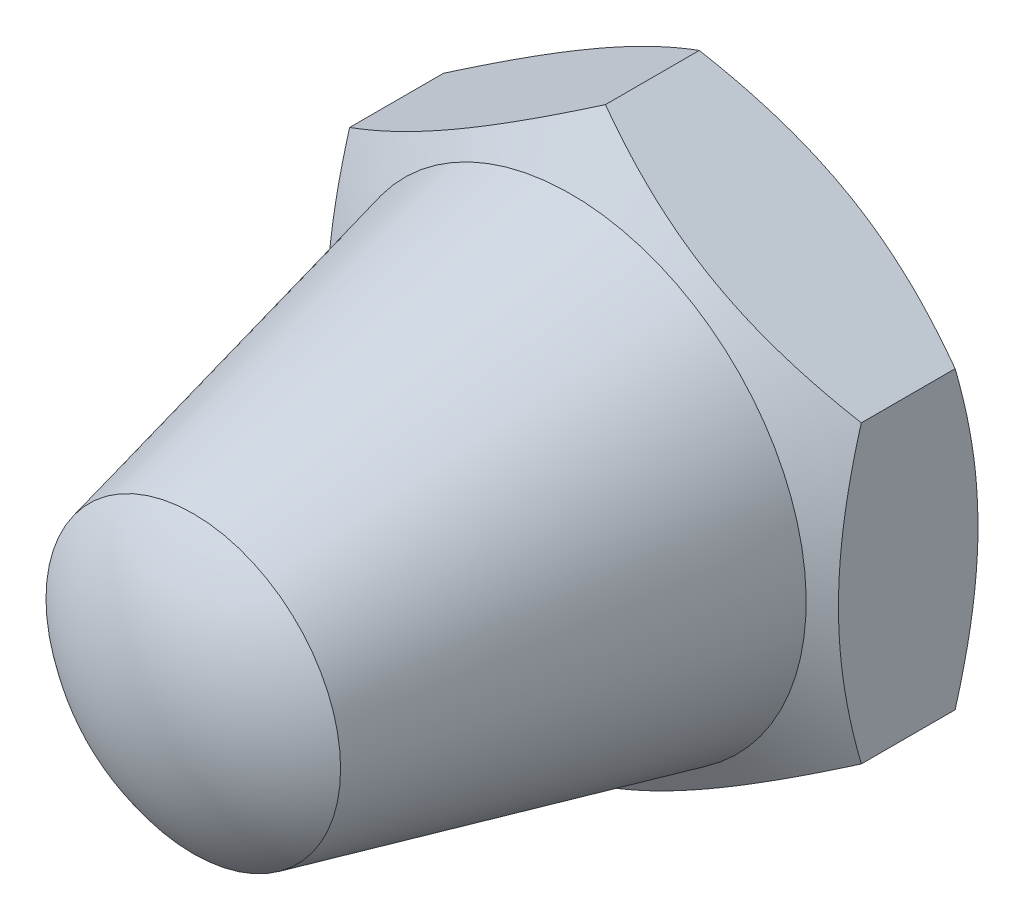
ISO-10303-21;
HEADER;
FILE_DESCRIPTION(('STEP AP214'),'2;1');
FILE_NAME('part.step','',(''),(''),'','','');
FILE_SCHEMA(('AUTOMOTIVE_DESIGN { 1 0 10303 214 1 1 1 1 }'));
ENDSEC;
DATA;
#1=APPLICATION_CONTEXT('core data for automotive mechanical design processes');
#2=APPLICATION_PROTOCOL_DEFINITION('international standard','automotive_design',2000,#1);
#3=PRODUCT_CONTEXT('',#1,'mechanical');
#4=PRODUCT('Part','Part','',(#3));
#5=PRODUCT_RELATED_PRODUCT_CATEGORY('part','',(#4));
#6=PRODUCT_DEFINITION_FORMATION('','',#4);
#7=PRODUCT_DEFINITION_CONTEXT('part definition',#1,'design');
#8=PRODUCT_DEFINITION('design','',#6,#7);
#9=PRODUCT_DEFINITION_SHAPE('','',#8);
#10=(LENGTH_UNIT() NAMED_UNIT(*) SI_UNIT(.MILLI.,.METRE.));
#11=(NAMED_UNIT(*) PLANE_ANGLE_UNIT() SI_UNIT($,.RADIAN.));
#12=(NAMED_UNIT(*) SI_UNIT($,.STERADIAN.) SOLID_ANGLE_UNIT());
#13=UNCERTAINTY_MEASURE_WITH_UNIT(LENGTH_MEASURE(1.E-05),#10,'distance_accuracy_value','');
#14=(GEOMETRIC_REPRESENTATION_CONTEXT(3) GLOBAL_UNCERTAINTY_ASSIGNED_CONTEXT((#13)) GLOBAL_UNIT_ASSIGNED_CONTEXT((#10,
#11,#12)) REPRESENTATION_CONTEXT('',''));
#15=CARTESIAN_POINT('',(0.,0.,0.));
#16=DIRECTION('',(0.,0.,1.));
#17=DIRECTION('',(1.,0.,0.));
#18=AXIS2_PLACEMENT_3D('',#15,#16,#17);
#19=CARTESIAN_POINT('',(0.,0.,0.));
#20=DIRECTION('',(0.,0.,1.));
#21=DIRECTION('',(0.500000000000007,-0.866025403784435,0.));
#22=AXIS2_PLACEMENT_3D('',#19,#20,#21);
#23=CONICAL_SURFACE('',#22,5.5,1.0471975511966);
#24=CARTESIAN_POINT('',(0.000200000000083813,-6.3509684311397,0.491306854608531));
#25=CARTESIAN_POINT('',(-0.120696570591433,-6.28116876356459,0.451013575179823));
#26=CARTESIAN_POINT('',(-0.242043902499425,-6.21110884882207,0.41254891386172));
#27=CARTESIAN_POINT('',(-0.485724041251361,-6.07042005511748,0.33978047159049));
#28=CARTESIAN_POINT('',(-0.608057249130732,-5.9997909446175,0.305478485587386));
#29=CARTESIAN_POINT('',(-0.977015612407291,-5.78677273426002,0.209489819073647));
#30=CARTESIAN_POINT('',(-1.22509718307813,-5.64354277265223,0.154892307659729));
#31=CARTESIAN_POINT('',(-1.59634674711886,-5.4292017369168,0.0908698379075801));
#32=CARTESIAN_POINT('',(-1.71840546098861,-5.35873110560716,0.0726315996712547));
#33=CARTESIAN_POINT('',(-1.96307442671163,-5.21747141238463,0.04204851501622));
#34=CARTESIAN_POINT('',(-2.08568462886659,-5.14668237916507,0.0297031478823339));
#35=CARTESIAN_POINT('',(-2.33111799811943,-5.00498135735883,0.0112204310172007));
#36=CARTESIAN_POINT('',(-2.45394076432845,-4.93406960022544,0.00507603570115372));
#37=CARTESIAN_POINT('',(-2.69969299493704,-4.79218448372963,-0.000879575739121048));
#38=CARTESIAN_POINT('',(-2.82262245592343,-4.7212111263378,-0.000690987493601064));
#39=CARTESIAN_POINT('',(-3.15941408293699,-4.52676438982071,0.008530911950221));
#40=CARTESIAN_POINT('',(-3.37316601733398,-4.40335465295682,0.0240139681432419));
#41=CARTESIAN_POINT('',(-3.79925015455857,-4.15735486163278,0.0731121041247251));
#42=CARTESIAN_POINT('',(-4.01158085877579,-4.03476567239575,0.106743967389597));
#43=CARTESIAN_POINT('',(-4.43852257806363,-3.78827075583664,0.190814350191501));
#44=CARTESIAN_POINT('',(-4.6530797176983,-3.66439613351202,0.241609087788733));
#45=CARTESIAN_POINT('',(-5.0789942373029,-3.41849427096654,0.356892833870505));
#46=CARTESIAN_POINT('',(-5.29035707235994,-3.29646388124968,0.421354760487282));
#47=CARTESIAN_POINT('',(-5.5002,-3.17531101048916,0.491306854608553));
#48=B_SPLINE_CURVE_WITH_KNOTS('',3,(#24,#25,#26,#27,#28,#29,#30,#31,#32,#33,#34,#35,#36,#37,#38,
#39,#40,#41,#42,#43,#44,#45,#46,#47),.UNSPECIFIED.,.F.,.F.,(4,2,2,2,2,2,2,2,2,2,2,4),(0.,
0.435859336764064,0.871905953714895,1.74581116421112,2.17206086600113,2.59827289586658,
3.02400011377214,3.44971418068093,4.19085033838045,4.93267305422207,5.6909489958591,
6.44773620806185),.UNSPECIFIED.);
#49=CARTESIAN_POINT('',(-2.74999999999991,-4.76313972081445,0.));
#50=VERTEX_POINT('',#49);
#51=CARTESIAN_POINT('',(-5.5,-3.175426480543,0.491240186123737));
#52=VERTEX_POINT('',#51);
#53=EDGE_CURVE('E144',#50,#52,#48,.T.);
#54=ORIENTED_EDGE('',*,*,#53,.T.);
#55=CARTESIAN_POINT('',(-5.5,-3.17565742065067,0.491306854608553));
#56=CARTESIAN_POINT('',(-5.5,-3.03605808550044,0.451013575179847));
#57=CARTESIAN_POINT('',(-5.5,-2.8959382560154,0.412548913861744));
#58=CARTESIAN_POINT('',(-5.5,-2.61456066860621,0.339780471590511));
#59=CARTESIAN_POINT('',(-5.5,-2.47330244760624,0.305478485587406));
#60=CARTESIAN_POINT('',(-5.5,-2.04726602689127,0.209489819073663));
#61=CARTESIAN_POINT('',(-5.5,-1.76080610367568,0.154892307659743));
#62=CARTESIAN_POINT('',(-5.5,-1.33212403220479,0.0908698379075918));
#63=CARTESIAN_POINT('',(-5.5,-1.19118276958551,0.0726315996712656));
#64=CARTESIAN_POINT('',(-5.5,-0.908663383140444,0.0420485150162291));
#65=CARTESIAN_POINT('',(-5.5,-0.767085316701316,0.029703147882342));
#66=CARTESIAN_POINT('',(-5.5,-0.483683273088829,0.0112204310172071));
#67=CARTESIAN_POINT('',(-5.5,-0.341859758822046,0.00507603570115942));
#68=CARTESIAN_POINT('',(-5.5,-0.058089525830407,-0.000879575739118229));
#69=CARTESIAN_POINT('',(-5.5,0.0838571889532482,-0.000690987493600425));
#70=CARTESIAN_POINT('',(-5.5,0.472750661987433,0.00853091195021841));
#71=CARTESIAN_POINT('',(-5.5,0.719570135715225,0.0240139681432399));
#72=CARTESIAN_POINT('',(-5.5,1.21156971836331,0.0731121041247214));
#73=CARTESIAN_POINT('',(-5.5,1.45674809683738,0.106743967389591));
#74=CARTESIAN_POINT('',(-5.5,1.9497379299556,0.19081435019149));
#75=CARTESIAN_POINT('',(-5.5,2.19748717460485,0.24160908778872));
#76=CARTESIAN_POINT('',(-5.5,2.68929089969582,0.356892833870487));
#77=CARTESIAN_POINT('',(-5.5,2.93335167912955,0.421354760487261));
#78=CARTESIAN_POINT('',(-5.5,3.1756574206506,0.49130685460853));
#79=B_SPLINE_CURVE_WITH_KNOTS('',3,(#55,#56,#57,#58,#59,#60,#61,#62,#63,#64,#65,#66,#67,#68,#69,
#70,#71,#72,#73,#74,#75,#76,#77,#78),.UNSPECIFIED.,.F.,.F.,(4,2,2,2,2,2,2,2,2,2,2,4),(0.,
0.435859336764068,0.871905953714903,1.74581116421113,2.17206086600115,2.5982728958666,
3.02400011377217,3.44971418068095,4.19085033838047,4.93267305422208,5.6909489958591,
6.44773620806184),.UNSPECIFIED.);
#80=CARTESIAN_POINT('',(-5.5,0.,0.));
#81=VERTEX_POINT('',#80);
#82=EDGE_CURVE('E96',#52,#81,#79,.T.);
#83=ORIENTED_EDGE('',*,*,#82,.T.);
#84=CARTESIAN_POINT('',(0.,0.,0.));
#85=DIRECTION('',(0.,0.,-1.));
#86=DIRECTION('',(-0.500000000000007,0.866025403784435,0.));
#87=AXIS2_PLACEMENT_3D('',#84,#85,#86);
#88=CIRCLE('',#87,5.5);
#89=EDGE_CURVE('E107',#50,#81,#88,.T.);
#90=ORIENTED_EDGE('',*,*,#89,.F.);
#91=EDGE_LOOP('',(#54,#83,#90));
#92=FACE_BOUND('',#91,.T.);
#93=ADVANCED_FACE('F14',(#92),#23,.T.);
#94=CARTESIAN_POINT('',(-2.75000000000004,4.76313972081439,0.));
#95=VERTEX_POINT('',#94);
#96=EDGE_CURVE('E104',#81,#95,#88,.T.);
#97=ORIENTED_EDGE('',*,*,#96,.F.);
#98=CARTESIAN_POINT('',(-5.5,3.17542648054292,0.491240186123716));
#99=VERTEX_POINT('',#98);
#100=EDGE_CURVE('E110',#81,#99,#79,.T.);
#101=ORIENTED_EDGE('',*,*,#100,.T.);
#102=CARTESIAN_POINT('',(-10.1652754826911,0.481928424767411,2.70008996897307));
#103=CARTESIAN_POINT('',(-9.95700252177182,0.602174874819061,2.58329769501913));
#104=CARTESIAN_POINT('',(-9.74825451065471,0.722695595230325,2.46761578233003));
#105=CARTESIAN_POINT('',(-9.32955588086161,0.964431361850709,2.23909648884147));
#106=CARTESIAN_POINT('',(-9.11960508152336,1.08564651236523,2.12625954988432));
#107=CARTESIAN_POINT('',(-8.69718017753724,1.32953364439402,1.90349331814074));
#108=CARTESIAN_POINT('',(-8.48469857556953,1.45220995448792,1.79358291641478));
#109=CARTESIAN_POINT('',(-8.05805535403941,1.69853253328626,1.57821612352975));
#110=CARTESIAN_POINT('',(-7.84389381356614,1.82217875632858,1.4727595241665));
#111=CARTESIAN_POINT('',(-7.40651825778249,2.07469765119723,1.26412065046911));
#112=CARTESIAN_POINT('',(-7.18323704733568,2.20360911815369,1.16112517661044));
#113=CARTESIAN_POINT('',(-6.73407282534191,2.46293420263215,0.962850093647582));
#114=CARTESIAN_POINT('',(-6.5081895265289,2.59334798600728,0.867571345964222));
#115=CARTESIAN_POINT('',(-6.05387554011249,2.85564628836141,0.687206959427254));
#116=CARTESIAN_POINT('',(-5.82545097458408,2.98752727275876,0.602100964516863));
#117=CARTESIAN_POINT('',(-5.36532503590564,3.25318110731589,0.444791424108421));
#118=CARTESIAN_POINT('',(-5.13362471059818,3.38695335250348,0.372583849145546));
#119=CARTESIAN_POINT('',(-4.66811361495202,3.65571630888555,0.24490271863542));
#120=CARTESIAN_POINT('',(-4.43432219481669,3.79069584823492,0.189336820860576));
#121=CARTESIAN_POINT('',(-3.96380196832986,4.06235082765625,0.0980537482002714));
#122=CARTESIAN_POINT('',(-3.72707344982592,4.19902610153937,0.0623346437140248));
#123=CARTESIAN_POINT('',(-3.25496508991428,4.47159799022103,0.0140608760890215));
#124=CARTESIAN_POINT('',(-3.01960886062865,4.60748097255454,0.00120590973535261));
#125=CARTESIAN_POINT('',(-2.54879233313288,4.87930702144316,-0.00104219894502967));
#126=CARTESIAN_POINT('',(-2.31333203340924,5.01525008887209,0.00956501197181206));
#127=CARTESIAN_POINT('',(-1.91442654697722,5.24555827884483,0.0466564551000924));
#128=CARTESIAN_POINT('',(-1.75055801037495,5.34016782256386,0.0674262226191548));
#129=CARTESIAN_POINT('',(-1.42400911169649,5.52870091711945,0.119054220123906));
#130=CARTESIAN_POINT('',(-1.26132891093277,5.6226243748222,0.149913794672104));
#131=CARTESIAN_POINT('',(-0.775293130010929,5.90323726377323,0.256006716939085));
#132=CARTESIAN_POINT('',(-0.454121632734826,6.08866571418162,0.344735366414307));
#133=CARTESIAN_POINT('',(0.0261416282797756,6.36594583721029,0.498757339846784));
#134=CARTESIAN_POINT('',(0.187719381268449,6.45923279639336,0.554305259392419));
#135=CARTESIAN_POINT('',(0.509305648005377,6.64490071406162,0.671212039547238));
#136=CARTESIAN_POINT('',(0.669314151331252,6.73728166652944,0.732570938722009));
#137=CARTESIAN_POINT('',(0.987811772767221,6.92116635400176,0.860111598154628));
#138=CARTESIAN_POINT('',(1.14630136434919,7.01267036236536,0.926291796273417));
#139=CARTESIAN_POINT('',(1.46196516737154,7.19491894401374,1.06269233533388));
#140=CARTESIAN_POINT('',(1.61913939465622,7.28566352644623,1.13291262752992));
#141=CARTESIAN_POINT('',(1.99164400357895,7.50072916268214,1.30396587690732));
#142=CARTESIAN_POINT('',(2.20645001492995,7.62474747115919,1.40631864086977));
#143=CARTESIAN_POINT('',(2.63421533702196,7.871717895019,1.61606120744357));
#144=CARTESIAN_POINT('',(2.8471745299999,7.99466994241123,1.72345132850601));
#145=CARTESIAN_POINT('',(3.27158775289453,8.23970503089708,1.94225171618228));
#146=CARTESIAN_POINT('',(3.48304145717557,8.36178788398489,2.05366282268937));
#147=CARTESIAN_POINT('',(3.90466020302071,8.60520958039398,2.27969591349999));
#148=CARTESIAN_POINT('',(4.11482521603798,8.72654840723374,2.39431796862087));
#149=CARTESIAN_POINT('',(4.53430461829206,8.96873495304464,2.62629189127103));
#150=CARTESIAN_POINT('',(4.74361781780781,9.08958198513,2.74364662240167));
#151=CARTESIAN_POINT('',(5.16133406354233,9.33075057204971,2.98049832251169));
#152=CARTESIAN_POINT('',(5.36973710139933,9.45107212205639,3.09999531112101));
#153=CARTESIAN_POINT('',(5.99374202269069,9.81134153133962,3.46109375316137));
#154=CARTESIAN_POINT('',(6.40819798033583,10.0506277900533,3.70533517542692));
#155=CARTESIAN_POINT('',(7.19985126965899,10.5076890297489,4.17784413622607));
#156=CARTESIAN_POINT('',(7.57722888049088,10.7255680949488,4.4057107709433));
#157=CARTESIAN_POINT('',(8.33057592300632,11.1605132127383,4.86456308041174));
#158=CARTESIAN_POINT('',(8.70654530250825,11.3775792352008,5.09554886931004));
#159=CARTESIAN_POINT('',(9.45642510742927,11.8105225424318,5.55929876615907));
#160=CARTESIAN_POINT('',(9.83033833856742,12.026401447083,5.79205683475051));
#161=CARTESIAN_POINT('',(10.5772652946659,12.4576399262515,6.25943215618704));
#162=CARTESIAN_POINT('',(10.9502790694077,12.6729995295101,6.49404930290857));
#163=CARTESIAN_POINT('',(11.3229623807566,12.8881683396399,6.72935957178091));
#164=B_SPLINE_CURVE_WITH_KNOTS('',3,(#102,#103,#104,#105,#106,#107,#108,#109,#110,#111,#112,
#113,#114,#115,#116,#117,#118,#119,#120,#121,#122,#123,#124,#125,#126,#127,#128,#129,#130,#131,
#132,#133,#134,#135,#136,#137,#138,#139,#140,#141,#142,#143,#144,#145,#146,#147,#148,#149,#150,
#151,#152,#153,#154,#155,#156,#157,#158,#159,#160,#161,#162,#163),.UNSPECIFIED.,.F.,.F.,(4,2,2,
2,2,2,2,2,2,2,2,2,2,2,2,2,2,2,2,2,2,2,2,2,2,2,2,2,2,2,4),(0.,0.8020666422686,1.60425709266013,
2.41075980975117,3.21722478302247,4.05003181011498,4.88293167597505,5.71413594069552,
6.54508008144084,7.37132416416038,8.19748790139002,9.01271815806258,9.82796068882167,
10.3987510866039,10.9696175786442,12.1119712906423,12.6959233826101,13.2798793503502,
13.863646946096,14.4474074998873,15.2523068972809,16.0572572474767,16.8623767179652,
17.667513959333,18.4735366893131,19.2795668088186,20.8914029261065,22.3666098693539,
23.84187094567,25.3133687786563,26.7847832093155),.UNSPECIFIED.);
#165=EDGE_CURVE('E182',#99,#95,#164,.T.);
#166=ORIENTED_EDGE('',*,*,#165,.T.);
#167=EDGE_LOOP('',(#97,#101,#166));
#168=FACE_BOUND('',#167,.T.);
#169=ADVANCED_FACE('F139',(#168),#23,.T.);
#170=CARTESIAN_POINT('',(2.74999999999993,4.76313972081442,0.));
#171=VERTEX_POINT('',#170);
#172=EDGE_CURVE('E109',#95,#171,#88,.T.);
#173=ORIENTED_EDGE('',*,*,#172,.F.);
#174=CARTESIAN_POINT('',(0.,6.35085296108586,0.491240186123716));
#175=VERTEX_POINT('',#174);
#176=EDGE_CURVE('E175',#95,#175,#164,.T.);
#177=ORIENTED_EDGE('',*,*,#176,.T.);
#178=CARTESIAN_POINT('',(-0.000200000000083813,6.3509684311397,0.491306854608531));
#179=CARTESIAN_POINT('',(0.120696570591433,6.28116876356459,0.451013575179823));
#180=CARTESIAN_POINT('',(0.242043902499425,6.21110884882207,0.41254891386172));
#181=CARTESIAN_POINT('',(0.485724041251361,6.07042005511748,0.33978047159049));
#182=CARTESIAN_POINT('',(0.608057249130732,5.9997909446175,0.305478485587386));
#183=CARTESIAN_POINT('',(0.977015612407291,5.78677273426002,0.209489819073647));
#184=CARTESIAN_POINT('',(1.22509718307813,5.64354277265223,0.154892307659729));
#185=CARTESIAN_POINT('',(1.59634674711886,5.4292017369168,0.0908698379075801));
#186=CARTESIAN_POINT('',(1.71840546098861,5.35873110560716,0.0726315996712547));
#187=CARTESIAN_POINT('',(1.96307442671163,5.21747141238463,0.04204851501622));
#188=CARTESIAN_POINT('',(2.08568462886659,5.14668237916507,0.0297031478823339));
#189=CARTESIAN_POINT('',(2.33111799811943,5.00498135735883,0.0112204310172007));
#190=CARTESIAN_POINT('',(2.45394076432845,4.93406960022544,0.00507603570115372));
#191=CARTESIAN_POINT('',(2.69969299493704,4.79218448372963,-0.000879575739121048));
#192=CARTESIAN_POINT('',(2.82262245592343,4.7212111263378,-0.000690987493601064));
#193=CARTESIAN_POINT('',(3.15941408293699,4.52676438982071,0.008530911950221));
#194=CARTESIAN_POINT('',(3.37316601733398,4.40335465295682,0.0240139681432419));
#195=CARTESIAN_POINT('',(3.79925015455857,4.15735486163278,0.0731121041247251));
#196=CARTESIAN_POINT('',(4.01158085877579,4.03476567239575,0.106743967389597));
#197=CARTESIAN_POINT('',(4.43852257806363,3.78827075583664,0.190814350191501));
#198=CARTESIAN_POINT('',(4.6530797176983,3.66439613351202,0.241609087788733));
#199=CARTESIAN_POINT('',(5.0789942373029,3.41849427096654,0.356892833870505));
#200=CARTESIAN_POINT('',(5.29035707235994,3.29646388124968,0.421354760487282));
#201=CARTESIAN_POINT('',(5.5002,3.17531101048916,0.491306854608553));
#202=B_SPLINE_CURVE_WITH_KNOTS('',3,(#178,#179,#180,#181,#182,#183,#184,#185,#186,#187,#188,
#189,#190,#191,#192,#193,#194,#195,#196,#197,#198,#199,#200,#201),.UNSPECIFIED.,.F.,.F.,(4,2,2,
2,2,2,2,2,2,2,2,4),(0.,0.435859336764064,0.871905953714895,1.74581116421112,2.17206086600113,
2.59827289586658,3.02400011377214,3.44971418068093,4.19085033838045,4.93267305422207,
5.6909489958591,6.44773620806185),.UNSPECIFIED.);
#203=EDGE_CURVE('E219',#175,#171,#202,.T.);
#204=ORIENTED_EDGE('',*,*,#203,.T.);
#205=EDGE_LOOP('',(#173,#177,#204));
#206=FACE_BOUND('',#205,.T.);
#207=ADVANCED_FACE('F282',(#206),#23,.T.);
#208=CARTESIAN_POINT('',(5.5,0.,0.));
#209=VERTEX_POINT('',#208);
#210=EDGE_CURVE('E271',#171,#209,#88,.T.);
#211=ORIENTED_EDGE('',*,*,#210,.F.);
#212=CARTESIAN_POINT('',(5.5,3.175426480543,0.491240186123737));
#213=VERTEX_POINT('',#212);
#214=EDGE_CURVE('E167',#171,#213,#202,.T.);
#215=ORIENTED_EDGE('',*,*,#214,.T.);
#216=CARTESIAN_POINT('',(5.5,3.17565742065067,0.491306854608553));
#217=CARTESIAN_POINT('',(5.5,3.03605808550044,0.451013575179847));
#218=CARTESIAN_POINT('',(5.5,2.8959382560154,0.412548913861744));
#219=CARTESIAN_POINT('',(5.5,2.61456066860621,0.339780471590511));
#220=CARTESIAN_POINT('',(5.5,2.47330244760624,0.305478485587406));
#221=CARTESIAN_POINT('',(5.5,2.04726602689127,0.209489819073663));
#222=CARTESIAN_POINT('',(5.5,1.76080610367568,0.154892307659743));
#223=CARTESIAN_POINT('',(5.5,1.33212403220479,0.0908698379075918));
#224=CARTESIAN_POINT('',(5.5,1.19118276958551,0.0726315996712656));
#225=CARTESIAN_POINT('',(5.5,0.908663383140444,0.0420485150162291));
#226=CARTESIAN_POINT('',(5.5,0.767085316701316,0.029703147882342));
#227=CARTESIAN_POINT('',(5.5,0.483683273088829,0.0112204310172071));
#228=CARTESIAN_POINT('',(5.5,0.341859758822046,0.00507603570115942));
#229=CARTESIAN_POINT('',(5.5,0.058089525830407,-0.000879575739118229));
#230=CARTESIAN_POINT('',(5.5,-0.0838571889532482,-0.000690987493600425));
#231=CARTESIAN_POINT('',(5.5,-0.472750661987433,0.00853091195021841));
#232=CARTESIAN_POINT('',(5.5,-0.719570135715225,0.0240139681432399));
#233=CARTESIAN_POINT('',(5.5,-1.21156971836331,0.0731121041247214));
#234=CARTESIAN_POINT('',(5.5,-1.45674809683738,0.106743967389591));
#235=CARTESIAN_POINT('',(5.5,-1.9497379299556,0.19081435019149));
#236=CARTESIAN_POINT('',(5.5,-2.19748717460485,0.24160908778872));
#237=CARTESIAN_POINT('',(5.5,-2.68929089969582,0.356892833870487));
#238=CARTESIAN_POINT('',(5.5,-2.93335167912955,0.421354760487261));
#239=CARTESIAN_POINT('',(5.5,-3.1756574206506,0.49130685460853));
#240=B_SPLINE_CURVE_WITH_KNOTS('',3,(#216,#217,#218,#219,#220,#221,#222,#223,#224,#225,#226,
#227,#228,#229,#230,#231,#232,#233,#234,#235,#236,#237,#238,#239),.UNSPECIFIED.,.F.,.F.,(4,2,2,
2,2,2,2,2,2,2,2,4),(0.,0.435859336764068,0.871905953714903,1.74581116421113,2.17206086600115,
2.5982728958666,3.02400011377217,3.44971418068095,4.19085033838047,4.93267305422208,
5.6909489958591,6.44773620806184),.UNSPECIFIED.);
#241=EDGE_CURVE('E217',#213,#209,#240,.T.);
#242=ORIENTED_EDGE('',*,*,#241,.T.);
#243=EDGE_LOOP('',(#211,#215,#242));
#244=FACE_BOUND('',#243,.T.);
#245=ADVANCED_FACE('F283',(#244),#23,.T.);
#246=CARTESIAN_POINT('',(2.75000000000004,-4.76313972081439,0.));
#247=VERTEX_POINT('',#246);
#248=EDGE_CURVE('E277',#209,#247,#88,.T.);
#249=ORIENTED_EDGE('',*,*,#248,.F.);
#250=CARTESIAN_POINT('',(5.5,-3.17542648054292,0.491240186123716));
#251=VERTEX_POINT('',#250);
#252=EDGE_CURVE('E159',#209,#251,#240,.T.);
#253=ORIENTED_EDGE('',*,*,#252,.T.);
#254=CARTESIAN_POINT('',(-4.665275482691,-9.04435101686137,2.70008996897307));
#255=CARTESIAN_POINT('',(-4.45700252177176,-8.92410456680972,2.58329769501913));
#256=CARTESIAN_POINT('',(-4.24825451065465,-8.80358384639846,2.46761578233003));
#257=CARTESIAN_POINT('',(-3.82955588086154,-8.56184807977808,2.23909648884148));
#258=CARTESIAN_POINT('',(-3.61960508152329,-8.44063292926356,2.12625954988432));
#259=CARTESIAN_POINT('',(-3.19718017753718,-8.19674579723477,1.90349331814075));
#260=CARTESIAN_POINT('',(-2.98469857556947,-8.07406948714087,1.79358291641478));
#261=CARTESIAN_POINT('',(-2.55805535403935,-7.82774690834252,1.57821612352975));
#262=CARTESIAN_POINT('',(-2.34389381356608,-7.70410068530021,1.47275952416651));
#263=CARTESIAN_POINT('',(-1.90651825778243,-7.45158179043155,1.26412065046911));
#264=CARTESIAN_POINT('',(-1.68323704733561,-7.32267032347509,1.16112517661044));
#265=CARTESIAN_POINT('',(-1.23407282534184,-7.06334523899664,0.962850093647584));
#266=CARTESIAN_POINT('',(-1.00818952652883,-6.9329314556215,0.867571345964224));
#267=CARTESIAN_POINT('',(-0.553875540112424,-6.67063315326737,0.687206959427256));
#268=CARTESIAN_POINT('',(-0.325450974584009,-6.53875216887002,0.602100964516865));
#269=CARTESIAN_POINT('',(0.13467496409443,-6.27309833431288,0.444791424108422));
#270=CARTESIAN_POINT('',(0.36637528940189,-6.1393260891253,0.372583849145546));
#271=CARTESIAN_POINT('',(0.831886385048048,-5.87056313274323,0.24490271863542));
#272=CARTESIAN_POINT('',(1.06567780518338,-5.73558359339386,0.189336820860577));
#273=CARTESIAN_POINT('',(1.53619803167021,-5.46392861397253,0.0980537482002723));
#274=CARTESIAN_POINT('',(1.77292655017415,-5.32725334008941,0.0623346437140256));
#275=CARTESIAN_POINT('',(2.24503491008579,-5.05468145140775,0.0140608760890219));
#276=CARTESIAN_POINT('',(2.48039113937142,-4.91879846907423,0.00120590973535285));
#277=CARTESIAN_POINT('',(2.95120766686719,-4.64697242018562,-0.00104219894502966));
#278=CARTESIAN_POINT('',(3.18666796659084,-4.5110293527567,0.00956501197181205));
#279=CARTESIAN_POINT('',(3.58557345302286,-4.28072116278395,0.0466564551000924));
#280=CARTESIAN_POINT('',(3.74944198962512,-4.18611161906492,0.0674262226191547));
#281=CARTESIAN_POINT('',(4.07599088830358,-3.99757852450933,0.119054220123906));
#282=CARTESIAN_POINT('',(4.2386710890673,-3.90365506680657,0.149913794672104));
#283=CARTESIAN_POINT('',(4.72470686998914,-3.62304217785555,0.256006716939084));
#284=CARTESIAN_POINT('',(5.04587836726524,-3.43761372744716,0.344735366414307));
#285=CARTESIAN_POINT('',(5.52614162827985,-3.16033360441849,0.498757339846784));
#286=CARTESIAN_POINT('',(5.68771938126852,-3.06704664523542,0.554305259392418));
#287=CARTESIAN_POINT('',(6.00930564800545,-2.88137872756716,0.671212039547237));
#288=CARTESIAN_POINT('',(6.16931415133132,-2.78899777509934,0.732570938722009));
#289=CARTESIAN_POINT('',(6.48781177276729,-2.60511308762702,0.860111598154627));
#290=CARTESIAN_POINT('',(6.64630136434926,-2.51360907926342,0.926291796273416));
#291=CARTESIAN_POINT('',(6.96196516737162,-2.33136049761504,1.06269233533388));
#292=CARTESIAN_POINT('',(7.11913939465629,-2.24061591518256,1.13291262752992));
#293=CARTESIAN_POINT('',(7.49164400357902,-2.02555027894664,1.30396587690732));
#294=CARTESIAN_POINT('',(7.70645001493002,-1.90153197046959,1.40631864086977));
#295=CARTESIAN_POINT('',(8.13421533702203,-1.65456154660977,1.61606120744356));
#296=CARTESIAN_POINT('',(8.34717452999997,-1.53160949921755,1.72345132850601));
#297=CARTESIAN_POINT('',(8.7715877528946,-1.2865744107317,1.94225171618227));
#298=CARTESIAN_POINT('',(8.98304145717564,-1.16449155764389,2.05366282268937));
#299=CARTESIAN_POINT('',(9.40466020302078,-0.921069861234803,2.27969591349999));
#300=CARTESIAN_POINT('',(9.61482521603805,-0.799731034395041,2.39431796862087));
#301=CARTESIAN_POINT('',(10.0343046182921,-0.557544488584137,2.62629189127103));
#302=CARTESIAN_POINT('',(10.2436178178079,-0.436697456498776,2.74364662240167));
#303=CARTESIAN_POINT('',(10.6613340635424,-0.195528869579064,2.98049832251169));
#304=CARTESIAN_POINT('',(10.8697371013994,-0.0752073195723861,3.09999531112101));
#305=CARTESIAN_POINT('',(11.4937420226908,0.285062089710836,3.46109375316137));
#306=CARTESIAN_POINT('',(11.9081979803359,0.524348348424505,3.70533517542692));
#307=CARTESIAN_POINT('',(12.6998512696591,0.981409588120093,4.17784413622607));
#308=CARTESIAN_POINT('',(13.077228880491,1.19928865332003,4.4057107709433));
#309=CARTESIAN_POINT('',(13.8305759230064,1.63423377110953,4.86456308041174));
#310=CARTESIAN_POINT('',(14.2065453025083,1.85129979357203,5.09554886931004));
#311=CARTESIAN_POINT('',(14.9564251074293,2.28424310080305,5.55929876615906));
#312=CARTESIAN_POINT('',(15.3303383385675,2.50012200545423,5.79205683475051));
#313=CARTESIAN_POINT('',(16.077265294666,2.93136048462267,6.25943215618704));
#314=CARTESIAN_POINT('',(16.4502790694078,3.1467200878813,6.49404930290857));
#315=CARTESIAN_POINT('',(16.8229623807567,3.36188889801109,6.72935957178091));
#316=B_SPLINE_CURVE_WITH_KNOTS('',3,(#254,#255,#256,#257,#258,#259,#260,#261,#262,#263,#264,
#265,#266,#267,#268,#269,#270,#271,#272,#273,#274,#275,#276,#277,#278,#279,#280,#281,#282,#283,
#284,#285,#286,#287,#288,#289,#290,#291,#292,#293,#294,#295,#296,#297,#298,#299,#300,#301,#302,
#303,#304,#305,#306,#307,#308,#309,#310,#311,#312,#313,#314,#315),.UNSPECIFIED.,.F.,.F.,(4,2,2,
2,2,2,2,2,2,2,2,2,2,2,2,2,2,2,2,2,2,2,2,2,2,2,2,2,2,2,4),(0.,0.802066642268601,1.60425709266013,
2.41075980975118,3.21722478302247,4.05003181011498,4.88293167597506,5.71413594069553,
6.54508008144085,7.37132416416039,8.19748790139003,9.01271815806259,9.82796068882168,
10.3987510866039,10.9696175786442,12.1119712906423,12.6959233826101,13.2798793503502,
13.863646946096,14.4474074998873,15.2523068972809,16.0572572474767,16.8623767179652,
17.667513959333,18.4735366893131,19.2795668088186,20.8914029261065,22.3666098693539,
23.84187094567,25.3133687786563,26.7847832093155),.UNSPECIFIED.);
#317=EDGE_CURVE('E228',#251,#247,#316,.F.);
#318=ORIENTED_EDGE('',*,*,#317,.T.);
#319=EDGE_LOOP('',(#249,#253,#318));
#320=FACE_BOUND('',#319,.T.);
#321=ADVANCED_FACE('F286',(#320),#23,.T.);
#322=EDGE_CURVE('E239',#247,#50,#88,.T.);
#323=ORIENTED_EDGE('',*,*,#322,.F.);
#324=CARTESIAN_POINT('',(0.,-6.35085296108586,0.491240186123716));
#325=VERTEX_POINT('',#324);
#326=EDGE_CURVE('E87',#247,#325,#316,.F.);
#327=ORIENTED_EDGE('',*,*,#326,.T.);
#328=EDGE_CURVE('E88',#325,#50,#48,.T.);
#329=ORIENTED_EDGE('',*,*,#328,.T.);
#330=EDGE_LOOP('',(#323,#327,#329));
#331=FACE_BOUND('',#330,.T.);
#332=ADVANCED_FACE('F135',(#331),#23,.T.);
#333=CARTESIAN_POINT('',(4.76313972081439,2.75000000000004,0.));
#334=DIRECTION('',(0.,0.,-1.));
#335=DIRECTION('',(-0.500000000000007,0.866025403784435,0.));
#336=AXIS2_PLACEMENT_3D('',#333,#334,#335);
#337=PLANE('',#336);
#338=CARTESIAN_POINT('',(0.,0.,0.));
#339=DIRECTION('',(0.,0.,-1.));
#340=DIRECTION('',(-0.866025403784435,-0.500000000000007,0.));
#341=AXIS2_PLACEMENT_3D('',#338,#339,#340);
#342=CIRCLE('',#341,3.);
#343=CARTESIAN_POINT('',(-2.5980762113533,-1.50000000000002,0.));
#344=VERTEX_POINT('',#343);
#345=EDGE_CURVE('E256',#344,#344,#342,.T.);
#346=ORIENTED_EDGE('',*,*,#345,.F.);
#347=EDGE_LOOP('',(#346));
#348=FACE_BOUND('',#347,.T.);
#349=ORIENTED_EDGE('',*,*,#172,.T.);
#350=ORIENTED_EDGE('',*,*,#210,.T.);
#351=ORIENTED_EDGE('',*,*,#248,.T.);
#352=ORIENTED_EDGE('',*,*,#322,.T.);
#353=ORIENTED_EDGE('',*,*,#89,.T.);
#354=ORIENTED_EDGE('',*,*,#96,.T.);
#355=EDGE_LOOP('',(#349,#350,#351,#352,#353,#354));
#356=FACE_BOUND('',#355,.T.);
#357=ADVANCED_FACE('F130',(#348,#356),#337,.T.);
#358=CARTESIAN_POINT('',(-5.5,3.17542648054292,-12.5));
#359=DIRECTION('',(-1.,0.,0.));
#360=DIRECTION('',(0.,-1.,0.));
#361=AXIS2_PLACEMENT_3D('',#358,#359,#360);
#362=PLANE('',#361);
#363=DIRECTION('',(0.,0.,1.));
#364=VECTOR('',#363,1.);
#365=CARTESIAN_POINT('',(-5.5,3.17542648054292,-12.5));
#366=LINE('',#365,#364);
#367=CARTESIAN_POINT('',(-5.5,3.17542648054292,2.50875981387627));
#368=VERTEX_POINT('',#367);
#369=EDGE_CURVE('E254',#99,#368,#366,.T.);
#370=ORIENTED_EDGE('',*,*,#369,.F.);
#371=ORIENTED_EDGE('',*,*,#100,.F.);
#372=ORIENTED_EDGE('',*,*,#82,.F.);
#373=DIRECTION('',(0.,0.,1.));
#374=VECTOR('',#373,1.);
#375=CARTESIAN_POINT('',(-5.5,-3.175426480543,-12.5));
#376=LINE('',#375,#374);
#377=CARTESIAN_POINT('',(-5.5,-3.175426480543,2.50875981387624));
#378=VERTEX_POINT('',#377);
#379=EDGE_CURVE('E35',#52,#378,#376,.T.);
#380=ORIENTED_EDGE('',*,*,#379,.T.);
#381=CARTESIAN_POINT('',(-5.5,3.1756574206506,2.50869314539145));
#382=CARTESIAN_POINT('',(-5.5,3.03605808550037,2.54898642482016));
#383=CARTESIAN_POINT('',(-5.5,2.89593825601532,2.58745108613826));
#384=CARTESIAN_POINT('',(-5.5,2.61456066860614,2.66021952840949));
#385=CARTESIAN_POINT('',(-5.5,2.47330244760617,2.6945215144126));
#386=CARTESIAN_POINT('',(-5.5,2.0472660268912,2.79051018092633));
#387=CARTESIAN_POINT('',(-5.5,1.76080610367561,2.84510769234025));
#388=CARTESIAN_POINT('',(-5.5,1.33212403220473,2.9091301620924));
#389=CARTESIAN_POINT('',(-5.5,1.19118276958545,2.92736840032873));
#390=CARTESIAN_POINT('',(-5.5,0.908663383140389,2.95795148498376));
#391=CARTESIAN_POINT('',(-5.5,0.767085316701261,2.97029685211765));
#392=CARTESIAN_POINT('',(-5.5,0.483683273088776,2.98877956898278));
#393=CARTESIAN_POINT('',(-5.5,0.341859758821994,2.99492396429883));
#394=CARTESIAN_POINT('',(-5.5,0.0580895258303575,3.0008795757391));
#395=CARTESIAN_POINT('',(-5.5,-0.0838571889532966,3.00069098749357));
#396=CARTESIAN_POINT('',(-5.5,-0.472750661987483,2.99146908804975));
#397=CARTESIAN_POINT('',(-5.5,-0.719570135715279,2.97598603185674));
#398=CARTESIAN_POINT('',(-5.5,-1.21156971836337,2.92688789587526));
#399=CARTESIAN_POINT('',(-5.5,-1.45674809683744,2.89325603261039));
#400=CARTESIAN_POINT('',(-5.5,-1.94973792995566,2.80918564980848));
#401=CARTESIAN_POINT('',(-5.5,-2.19748717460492,2.75839091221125));
#402=CARTESIAN_POINT('',(-5.5,-2.68929089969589,2.64310716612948));
#403=CARTESIAN_POINT('',(-5.5,-2.93335167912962,2.5786452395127));
#404=CARTESIAN_POINT('',(-5.5,-3.17565742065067,2.50869314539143));
#405=B_SPLINE_CURVE_WITH_KNOTS('',3,(#381,#382,#383,#384,#385,#386,#387,#388,#389,#390,#391,
#392,#393,#394,#395,#396,#397,#398,#399,#400,#401,#402,#403,#404),.UNSPECIFIED.,.F.,.F.,(4,2,2,
2,2,2,2,2,2,2,2,4),(0.,0.435859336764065,0.871905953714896,1.74581116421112,2.17206086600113,
2.59827289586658,3.02400011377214,3.44971418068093,4.19085033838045,4.93267305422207,
5.6909489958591,6.44773620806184),.UNSPECIFIED.);
#406=EDGE_CURVE('E93',#368,#378,#405,.T.);
#407=ORIENTED_EDGE('',*,*,#406,.F.);
#408=EDGE_LOOP('',(#370,#371,#372,#380,#407));
#409=FACE_BOUND('',#408,.T.);
#410=ADVANCED_FACE('F92',(#409),#362,.T.);
#411=CARTESIAN_POINT('',(0.,6.35085296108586,-12.5));
#412=DIRECTION('',(-0.500000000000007,0.866025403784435,0.));
#413=DIRECTION('',(-0.866025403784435,-0.500000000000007,0.));
#414=AXIS2_PLACEMENT_3D('',#411,#412,#413);
#415=PLANE('',#414);
#416=DIRECTION('',(0.,0.,1.));
#417=VECTOR('',#416,1.);
#418=CARTESIAN_POINT('',(0.,6.35085296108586,-12.5));
#419=LINE('',#418,#417);
#420=CARTESIAN_POINT('',(0.,6.35085296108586,2.50875981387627));
#421=VERTEX_POINT('',#420);
#422=EDGE_CURVE('E251',#175,#421,#419,.T.);
#423=ORIENTED_EDGE('',*,*,#422,.F.);
#424=ORIENTED_EDGE('',*,*,#176,.F.);
#425=ORIENTED_EDGE('',*,*,#165,.F.);
#426=ORIENTED_EDGE('',*,*,#369,.T.);
#427=CARTESIAN_POINT('',(-10.1344534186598,0.499723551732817,0.317188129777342));
#428=CARTESIAN_POINT('',(-9.92642850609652,0.619826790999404,0.433698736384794));
#429=CARTESIAN_POINT('',(-9.71792578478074,0.740205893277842,0.549091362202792));
#430=CARTESIAN_POINT('',(-9.2997106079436,0.981662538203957,0.777011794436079));
#431=CARTESIAN_POINT('',(-9.08999796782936,1.10274018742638,0.889539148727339));
#432=CARTESIAN_POINT('',(-8.66802728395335,1.34636507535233,1.1116668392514));
#433=CARTESIAN_POINT('',(-8.45576159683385,1.4689167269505,1.22124788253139));
#434=CARTESIAN_POINT('',(-8.02954101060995,1.71499529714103,1.43592160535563));
#435=CARTESIAN_POINT('',(-7.81558619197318,1.83852216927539,1.54101449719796));
#436=CARTESIAN_POINT('',(-7.37876523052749,2.09072086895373,1.74880037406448));
#437=CARTESIAN_POINT('',(-7.15583296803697,2.21943087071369,1.8513090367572));
#438=CARTESIAN_POINT('',(-6.70735940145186,2.47835720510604,2.04856142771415));
#439=CARTESIAN_POINT('',(-6.48181780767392,2.60857370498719,2.14330428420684));
#440=CARTESIAN_POINT('',(-6.02818966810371,2.87047603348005,2.32253603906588));
#441=CARTESIAN_POINT('',(-5.80010934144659,3.0021582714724,2.40704571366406));
#442=CARTESIAN_POINT('',(-5.3406770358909,3.26741163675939,2.56309752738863));
#443=CARTESIAN_POINT('',(-5.10932611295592,3.40098215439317,2.63464375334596));
#444=CARTESIAN_POINT('',(-4.64449732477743,3.66935118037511,2.76095502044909));
#445=CARTESIAN_POINT('',(-4.41103821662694,3.80413885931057,2.81581040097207));
#446=CARTESIAN_POINT('',(-3.94121922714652,4.0753889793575,2.90563425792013));
#447=CARTESIAN_POINT('',(-3.70485962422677,4.21185125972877,2.94060462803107));
#448=CARTESIAN_POINT('',(-3.23350729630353,4.48398665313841,2.98741101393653));
#449=CARTESIAN_POINT('',(-2.99853726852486,4.61964666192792,2.99954428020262));
#450=CARTESIAN_POINT('',(-2.52854460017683,4.89099705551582,3.00043005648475));
#451=CARTESIAN_POINT('',(-2.29352195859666,5.02668744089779,2.9891820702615));
#452=CARTESIAN_POINT('',(-1.89446921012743,5.25708065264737,2.95102792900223));
#453=CARTESIAN_POINT('',(-1.73001181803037,5.35203017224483,2.92974037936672));
#454=CARTESIAN_POINT('',(-1.4023095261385,5.54122917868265,2.87704309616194));
#455=CARTESIAN_POINT('',(-1.23906479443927,5.635478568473,2.84563198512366));
#456=CARTESIAN_POINT('',(-0.751363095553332,5.91705327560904,2.73786529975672));
#457=CARTESIAN_POINT('',(-0.429121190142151,6.10309972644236,2.64799613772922));
#458=CARTESIAN_POINT('',(0.052744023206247,6.38130473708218,2.49227965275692));
#459=CARTESIAN_POINT('',(0.214867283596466,6.47490664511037,2.43616090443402));
#460=CARTESIAN_POINT('',(0.537538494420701,6.66120095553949,2.31812622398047));
#461=CARTESIAN_POINT('',(0.698086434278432,6.7538933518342,2.2562102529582));
#462=CARTESIAN_POINT('',(1.01765874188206,6.9383985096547,2.1275721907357));
#463=CARTESIAN_POINT('',(1.17668359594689,7.03021155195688,2.06085169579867));
#464=CARTESIAN_POINT('',(1.49341719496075,7.21307778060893,1.92338647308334));
#465=CARTESIAN_POINT('',(1.65112595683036,7.30413097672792,1.85264179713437));
#466=CARTESIAN_POINT('',(2.0295015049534,7.52258620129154,1.67824012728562));
#467=CARTESIAN_POINT('',(2.24959700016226,7.64965839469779,1.57293336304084));
#468=CARTESIAN_POINT('',(2.68787356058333,7.9026974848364,1.3571201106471));
#469=CARTESIAN_POINT('',(2.90605449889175,8.02866430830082,1.24661328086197));
#470=CARTESIAN_POINT('',(3.34086446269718,8.27970195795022,1.02146878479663));
#471=CARTESIAN_POINT('',(3.55749314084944,8.40477258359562,0.906830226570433));
#472=CARTESIAN_POINT('',(3.98942656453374,8.65414946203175,0.67426850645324));
#473=CARTESIAN_POINT('',(4.20473128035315,8.77845569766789,0.556345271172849));
#474=CARTESIAN_POINT('',(4.6344754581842,9.02656861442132,0.317712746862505));
#475=CARTESIAN_POINT('',(4.84891367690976,9.15037457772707,0.197000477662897));
#476=CARTESIAN_POINT('',(5.27686187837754,9.39745058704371,-0.0466003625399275));
#477=CARTESIAN_POINT('',(5.4903718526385,9.52072062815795,-0.169488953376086));
#478=CARTESIAN_POINT('',(6.12967542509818,9.88982271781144,-0.540793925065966));
#479=CARTESIAN_POINT('',(6.55430419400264,10.1349822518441,-0.791883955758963));
#480=CARTESIAN_POINT('',(7.36469050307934,10.6028590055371,-1.27711141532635));
#481=CARTESIAN_POINT('',(7.75063383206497,10.8256834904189,-1.51083699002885));
#482=CARTESIAN_POINT('',(8.52110736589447,11.2705165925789,-1.98141180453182));
#483=CARTESIAN_POINT('',(8.90563751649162,11.4925251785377,-2.21826116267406));
#484=CARTESIAN_POINT('',(9.67260589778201,11.9353345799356,-2.6937143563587));
#485=CARTESIAN_POINT('',(10.0550469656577,12.1561370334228,-2.93231209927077));
#486=CARTESIAN_POINT('',(10.8190296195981,12.5972226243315,-3.41136076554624));
#487=CARTESIAN_POINT('',(11.2005712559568,12.8175057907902,-3.65181158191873));
#488=CARTESIAN_POINT('',(11.5817838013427,13.0375989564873,-3.89295145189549));
#489=B_SPLINE_CURVE_WITH_KNOTS('',3,(#427,#428,#429,#430,#431,#432,#433,#434,#435,#436,#437,
#438,#439,#440,#441,#442,#443,#444,#445,#446,#447,#448,#449,#450,#451,#452,#453,#454,#455,#456,
#457,#458,#459,#460,#461,#462,#463,#464,#465,#466,#467,#468,#469,#470,#471,#472,#473,#474,#475,
#476,#477,#478,#479,#480,#481,#482,#483,#484,#485,#486,#487,#488),.UNSPECIFIED.,.F.,.F.,(4,2,2,
2,2,2,2,2,2,2,2,2,2,2,2,2,2,2,2,2,2,2,2,2,2,2,2,2,2,2,4),(0.,0.800924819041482,1.60197524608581,
2.40739108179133,3.21276877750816,4.04391063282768,4.87514566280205,5.70466370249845,
6.53391977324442,7.35860419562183,8.1832100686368,8.99700649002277,9.81082018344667,
10.3838076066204,10.9568730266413,12.1036361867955,12.6898898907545,13.2761475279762,
13.8622112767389,14.4482674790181,15.2734821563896,16.0987511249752,16.924199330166,
17.7496659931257,18.5760597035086,19.4024609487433,21.0550266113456,22.5646743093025,
24.0743793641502,25.5801946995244,27.0859237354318),.UNSPECIFIED.);
#490=EDGE_CURVE('E103',#421,#368,#489,.F.);
#491=ORIENTED_EDGE('',*,*,#490,.F.);
#492=EDGE_LOOP('',(#423,#424,#425,#426,#491));
#493=FACE_BOUND('',#492,.T.);
#494=ADVANCED_FACE('F129',(#493),#415,.T.);
#495=CARTESIAN_POINT('',(5.5,3.175426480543,-12.5));
#496=DIRECTION('',(0.499999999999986,0.866025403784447,0.));
#497=DIRECTION('',(-0.866025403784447,0.499999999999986,0.));
#498=AXIS2_PLACEMENT_3D('',#495,#496,#497);
#499=PLANE('',#498);
#500=DIRECTION('',(0.,0.,1.));
#501=VECTOR('',#500,1.);
#502=CARTESIAN_POINT('',(5.5,3.175426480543,-12.5));
#503=LINE('',#502,#501);
#504=CARTESIAN_POINT('',(5.5,3.175426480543,2.50875981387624));
#505=VERTEX_POINT('',#504);
#506=EDGE_CURVE('E246',#213,#505,#503,.T.);
#507=ORIENTED_EDGE('',*,*,#506,.F.);
#508=ORIENTED_EDGE('',*,*,#214,.F.);
#509=ORIENTED_EDGE('',*,*,#203,.F.);
#510=ORIENTED_EDGE('',*,*,#422,.T.);
#511=CARTESIAN_POINT('',(5.5002,3.17531101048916,2.50869314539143));
#512=CARTESIAN_POINT('',(5.37930342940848,3.24511067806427,2.54898642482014));
#513=CARTESIAN_POINT('',(5.25795609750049,3.31517059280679,2.58745108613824));
#514=CARTESIAN_POINT('',(5.01427595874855,3.45585938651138,2.66021952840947));
#515=CARTESIAN_POINT('',(4.89194275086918,3.52648849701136,2.69452151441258));
#516=CARTESIAN_POINT('',(4.52298438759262,3.73950670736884,2.79051018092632));
#517=CARTESIAN_POINT('',(4.27490281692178,3.88273666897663,2.84510769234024));
#518=CARTESIAN_POINT('',(3.90365325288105,4.09707770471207,2.90913016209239));
#519=CARTESIAN_POINT('',(3.7815945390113,4.16754833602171,2.92736840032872));
#520=CARTESIAN_POINT('',(3.53692557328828,4.30880802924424,2.95795148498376));
#521=CARTESIAN_POINT('',(3.41431537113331,4.3795970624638,2.97029685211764));
#522=CARTESIAN_POINT('',(3.16888200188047,4.52129808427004,2.98877956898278));
#523=CARTESIAN_POINT('',(3.04605923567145,4.59220984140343,2.99492396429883));
#524=CARTESIAN_POINT('',(2.80030700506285,4.73409495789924,3.0008795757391));
#525=CARTESIAN_POINT('',(2.67737754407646,4.80506831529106,3.00069098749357));
#526=CARTESIAN_POINT('',(2.34058591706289,4.99951505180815,2.99146908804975));
#527=CARTESIAN_POINT('',(2.12683398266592,5.12292478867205,2.97598603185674));
#528=CARTESIAN_POINT('',(1.70074984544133,5.36892457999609,2.92688789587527));
#529=CARTESIAN_POINT('',(1.48841914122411,5.49151376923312,2.8932560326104));
#530=CARTESIAN_POINT('',(1.06147742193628,5.73800868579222,2.8091856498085));
#531=CARTESIAN_POINT('',(0.846920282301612,5.86188330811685,2.75839091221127));
#532=CARTESIAN_POINT('',(0.421005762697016,6.10778517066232,2.6431071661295));
#533=CARTESIAN_POINT('',(0.209642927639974,6.22981556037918,2.57864523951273));
#534=CARTESIAN_POINT('',(-0.000200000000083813,6.3509684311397,2.50869314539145));
#535=B_SPLINE_CURVE_WITH_KNOTS('',3,(#511,#512,#513,#514,#515,#516,#517,#518,#519,#520,#521,
#522,#523,#524,#525,#526,#527,#528,#529,#530,#531,#532,#533,#534),.UNSPECIFIED.,.F.,.F.,(4,2,2,
2,2,2,2,2,2,2,2,4),(0.,0.43585933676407,0.871905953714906,1.74581116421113,2.17206086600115,
2.5982728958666,3.02400011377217,3.44971418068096,4.19085033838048,4.93267305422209,
5.69094899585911,6.44773620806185),.UNSPECIFIED.);
#536=EDGE_CURVE('E183',#505,#421,#535,.T.);
#537=ORIENTED_EDGE('',*,*,#536,.F.);
#538=EDGE_LOOP('',(#507,#508,#509,#510,#537));
#539=FACE_BOUND('',#538,.T.);
#540=ADVANCED_FACE('F195',(#539),#499,.T.);
#541=CARTESIAN_POINT('',(5.5,-3.17542648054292,-12.5));
#542=DIRECTION('',(1.,0.,0.));
#543=DIRECTION('',(0.,1.,0.));
#544=AXIS2_PLACEMENT_3D('',#541,#542,#543);
#545=PLANE('',#544);
#546=DIRECTION('',(0.,0.,1.));
#547=VECTOR('',#546,1.);
#548=CARTESIAN_POINT('',(5.5,-3.17542648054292,-12.5));
#549=LINE('',#548,#547);
#550=CARTESIAN_POINT('',(5.5,-3.17542648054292,2.50875981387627));
#551=VERTEX_POINT('',#550);
#552=EDGE_CURVE('E244',#251,#551,#549,.T.);
#553=ORIENTED_EDGE('',*,*,#552,.F.);
#554=ORIENTED_EDGE('',*,*,#252,.F.);
#555=ORIENTED_EDGE('',*,*,#241,.F.);
#556=ORIENTED_EDGE('',*,*,#506,.T.);
#557=CARTESIAN_POINT('',(5.5,-3.1756574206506,2.50869314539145));
#558=CARTESIAN_POINT('',(5.5,-3.03605808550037,2.54898642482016));
#559=CARTESIAN_POINT('',(5.5,-2.89593825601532,2.58745108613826));
#560=CARTESIAN_POINT('',(5.5,-2.61456066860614,2.66021952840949));
#561=CARTESIAN_POINT('',(5.5,-2.47330244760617,2.6945215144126));
#562=CARTESIAN_POINT('',(5.5,-2.0472660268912,2.79051018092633));
#563=CARTESIAN_POINT('',(5.5,-1.76080610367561,2.84510769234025));
#564=CARTESIAN_POINT('',(5.5,-1.33212403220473,2.9091301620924));
#565=CARTESIAN_POINT('',(5.5,-1.19118276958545,2.92736840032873));
#566=CARTESIAN_POINT('',(5.5,-0.908663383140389,2.95795148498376));
#567=CARTESIAN_POINT('',(5.5,-0.767085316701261,2.97029685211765));
#568=CARTESIAN_POINT('',(5.5,-0.483683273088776,2.98877956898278));
#569=CARTESIAN_POINT('',(5.5,-0.341859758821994,2.99492396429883));
#570=CARTESIAN_POINT('',(5.5,-0.0580895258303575,3.0008795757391));
#571=CARTESIAN_POINT('',(5.5,0.0838571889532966,3.00069098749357));
#572=CARTESIAN_POINT('',(5.5,0.472750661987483,2.99146908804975));
#573=CARTESIAN_POINT('',(5.5,0.719570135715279,2.97598603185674));
#574=CARTESIAN_POINT('',(5.5,1.21156971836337,2.92688789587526));
#575=CARTESIAN_POINT('',(5.5,1.45674809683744,2.89325603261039));
#576=CARTESIAN_POINT('',(5.5,1.94973792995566,2.80918564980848));
#577=CARTESIAN_POINT('',(5.5,2.19748717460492,2.75839091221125));
#578=CARTESIAN_POINT('',(5.5,2.68929089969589,2.64310716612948));
#579=CARTESIAN_POINT('',(5.5,2.93335167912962,2.5786452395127));
#580=CARTESIAN_POINT('',(5.5,3.17565742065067,2.50869314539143));
#581=B_SPLINE_CURVE_WITH_KNOTS('',3,(#557,#558,#559,#560,#561,#562,#563,#564,#565,#566,#567,
#568,#569,#570,#571,#572,#573,#574,#575,#576,#577,#578,#579,#580),.UNSPECIFIED.,.F.,.F.,(4,2,2,
2,2,2,2,2,2,2,2,4),(0.,0.435859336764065,0.871905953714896,1.74581116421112,2.17206086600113,
2.59827289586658,3.02400011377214,3.44971418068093,4.19085033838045,4.93267305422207,
5.6909489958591,6.44773620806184),.UNSPECIFIED.);
#582=EDGE_CURVE('E211',#551,#505,#581,.T.);
#583=ORIENTED_EDGE('',*,*,#582,.F.);
#584=EDGE_LOOP('',(#553,#554,#555,#556,#583));
#585=FACE_BOUND('',#584,.T.);
#586=ADVANCED_FACE('F202',(#585),#545,.T.);
#587=CARTESIAN_POINT('',(0.,-6.35085296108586,-12.5));
#588=DIRECTION('',(0.500000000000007,-0.866025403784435,0.));
#589=DIRECTION('',(0.866025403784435,0.500000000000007,0.));
#590=AXIS2_PLACEMENT_3D('',#587,#588,#589);
#591=PLANE('',#590);
#592=DIRECTION('',(0.,0.,1.));
#593=VECTOR('',#592,1.);
#594=CARTESIAN_POINT('',(0.,-6.35085296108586,-12.5));
#595=LINE('',#594,#593);
#596=CARTESIAN_POINT('',(0.,-6.35085296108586,2.50875981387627));
#597=VERTEX_POINT('',#596);
#598=EDGE_CURVE('E29',#325,#597,#595,.T.);
#599=ORIENTED_EDGE('',*,*,#598,.F.);
#600=ORIENTED_EDGE('',*,*,#326,.F.);
#601=ORIENTED_EDGE('',*,*,#317,.F.);
#602=ORIENTED_EDGE('',*,*,#552,.T.);
#603=CARTESIAN_POINT('',(-4.63445341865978,-9.02655588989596,0.317188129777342));
#604=CARTESIAN_POINT('',(-4.42642850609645,-8.90645265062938,0.433698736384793));
#605=CARTESIAN_POINT('',(-4.21792578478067,-8.78607354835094,0.549091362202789));
#606=CARTESIAN_POINT('',(-3.79971060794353,-8.54461690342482,0.777011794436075));
#607=CARTESIAN_POINT('',(-3.5899979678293,-8.4235392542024,0.889539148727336));
#608=CARTESIAN_POINT('',(-3.16802728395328,-8.17991436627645,1.11166683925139));
#609=CARTESIAN_POINT('',(-2.95576159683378,-8.05736271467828,1.22124788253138));
#610=CARTESIAN_POINT('',(-2.52954101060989,-7.81128414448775,1.43592160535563));
#611=CARTESIAN_POINT('',(-2.31558619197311,-7.68775727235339,1.54101449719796));
#612=CARTESIAN_POINT('',(-1.87876523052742,-7.43555857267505,1.74880037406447));
#613=CARTESIAN_POINT('',(-1.6558329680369,-7.30684857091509,1.85130903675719));
#614=CARTESIAN_POINT('',(-1.20735940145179,-7.04792223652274,2.04856142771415));
#615=CARTESIAN_POINT('',(-0.981817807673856,-6.91770573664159,2.14330428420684));
#616=CARTESIAN_POINT('',(-0.528189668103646,-6.65580340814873,2.32253603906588));
#617=CARTESIAN_POINT('',(-0.300109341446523,-6.52412117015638,2.40704571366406));
#618=CARTESIAN_POINT('',(0.159322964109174,-6.25886780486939,2.56309752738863));
#619=CARTESIAN_POINT('',(0.390673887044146,-6.12529728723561,2.63464375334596));
#620=CARTESIAN_POINT('',(0.855502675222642,-5.85692826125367,2.76095502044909));
#621=CARTESIAN_POINT('',(1.08896178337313,-5.72214058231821,2.81581040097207));
#622=CARTESIAN_POINT('',(1.55878077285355,-5.45089046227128,2.90563425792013));
#623=CARTESIAN_POINT('',(1.7951403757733,-5.31442818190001,2.94060462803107));
#624=CARTESIAN_POINT('',(2.26649270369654,-5.04229278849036,2.98741101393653));
#625=CARTESIAN_POINT('',(2.50146273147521,-4.90663277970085,2.99954428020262));
#626=CARTESIAN_POINT('',(2.97145539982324,-4.63528238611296,3.00043005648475));
#627=CARTESIAN_POINT('',(3.20647804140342,-4.49959200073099,2.9891820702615));
#628=CARTESIAN_POINT('',(3.60553078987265,-4.26919878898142,2.95102792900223));
#629=CARTESIAN_POINT('',(3.76998818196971,-4.17424926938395,2.92974037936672));
#630=CARTESIAN_POINT('',(4.09769047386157,-3.98505026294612,2.87704309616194));
#631=CARTESIAN_POINT('',(4.26093520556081,-3.89080087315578,2.84563198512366));
#632=CARTESIAN_POINT('',(4.74863690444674,-3.60922616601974,2.73786529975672));
#633=CARTESIAN_POINT('',(5.07087880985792,-3.42317971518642,2.64799613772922));
#634=CARTESIAN_POINT('',(5.55274402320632,-3.1449747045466,2.49227965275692));
#635=CARTESIAN_POINT('',(5.71486728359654,-3.0513727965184,2.43616090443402));
#636=CARTESIAN_POINT('',(6.03753849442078,-2.86507848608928,2.31812622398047));
#637=CARTESIAN_POINT('',(6.19808643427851,-2.77238608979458,2.25621025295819));
#638=CARTESIAN_POINT('',(6.51765874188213,-2.58788093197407,2.12757219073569));
#639=CARTESIAN_POINT('',(6.67668359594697,-2.4960678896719,2.06085169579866));
#640=CARTESIAN_POINT('',(6.99341719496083,-2.31320166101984,1.92338647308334));
#641=CARTESIAN_POINT('',(7.15112595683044,-2.22214846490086,1.85264179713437));
#642=CARTESIAN_POINT('',(7.52950150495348,-2.00369324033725,1.67824012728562));
#643=CARTESIAN_POINT('',(7.74959700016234,-1.87662104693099,1.57293336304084));
#644=CARTESIAN_POINT('',(8.18787356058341,-1.62358195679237,1.35712011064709));
#645=CARTESIAN_POINT('',(8.40605449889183,-1.49761513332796,1.24661328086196));
#646=CARTESIAN_POINT('',(8.84086446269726,-1.24657748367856,1.02146878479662));
#647=CARTESIAN_POINT('',(9.05749314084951,-1.12150685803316,0.906830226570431));
#648=CARTESIAN_POINT('',(9.48942656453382,-0.872129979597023,0.674268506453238));
#649=CARTESIAN_POINT('',(9.70473128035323,-0.74782374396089,0.556345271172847));
#650=CARTESIAN_POINT('',(10.1344754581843,-0.499710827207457,0.317712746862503));
#651=CARTESIAN_POINT('',(10.3489136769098,-0.375904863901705,0.197000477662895));
#652=CARTESIAN_POINT('',(10.7768618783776,-0.128828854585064,-0.0466003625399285));
#653=CARTESIAN_POINT('',(10.9903718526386,-0.00555881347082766,-0.169488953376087));
#654=CARTESIAN_POINT('',(11.6296754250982,0.363543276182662,-0.540793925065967));
#655=CARTESIAN_POINT('',(12.0543041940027,0.608702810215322,-0.791883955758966));
#656=CARTESIAN_POINT('',(12.8646905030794,1.07657956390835,-1.27711141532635));
#657=CARTESIAN_POINT('',(13.250633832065,1.29940404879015,-1.51083699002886));
#658=CARTESIAN_POINT('',(14.0211073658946,1.7442371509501,-1.98141180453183));
#659=CARTESIAN_POINT('',(14.4056375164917,1.9662457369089,-2.21826116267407));
#660=CARTESIAN_POINT('',(15.1726058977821,2.40905513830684,-2.69371435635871));
#661=CARTESIAN_POINT('',(15.5550469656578,2.62985759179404,-2.93231209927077));
#662=CARTESIAN_POINT('',(16.3190296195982,3.07094318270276,-3.41136076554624));
#663=CARTESIAN_POINT('',(16.7005712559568,3.29122634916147,-3.65181158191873));
#664=CARTESIAN_POINT('',(17.0817838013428,3.51131951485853,-3.89295145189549));
#665=B_SPLINE_CURVE_WITH_KNOTS('',3,(#603,#604,#605,#606,#607,#608,#609,#610,#611,#612,#613,
#614,#615,#616,#617,#618,#619,#620,#621,#622,#623,#624,#625,#626,#627,#628,#629,#630,#631,#632,
#633,#634,#635,#636,#637,#638,#639,#640,#641,#642,#643,#644,#645,#646,#647,#648,#649,#650,#651,
#652,#653,#654,#655,#656,#657,#658,#659,#660,#661,#662,#663,#664),.UNSPECIFIED.,.F.,.F.,(4,2,2,
2,2,2,2,2,2,2,2,2,2,2,2,2,2,2,2,2,2,2,2,2,2,2,2,2,2,2,4),(0.,0.800924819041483,1.60197524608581,
2.40739108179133,3.21276877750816,4.04391063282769,4.87514566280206,5.70466370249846,
6.53391977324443,7.35860419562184,8.18321006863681,8.99700649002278,9.81082018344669,
10.3838076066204,10.9568730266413,12.1036361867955,12.6898898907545,13.2761475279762,
13.8622112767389,14.4482674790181,15.2734821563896,16.0987511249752,16.924199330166,
17.7496659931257,18.5760597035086,19.4024609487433,21.0550266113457,22.5646743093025,
24.0743793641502,25.5801946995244,27.0859237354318),.UNSPECIFIED.);
#666=EDGE_CURVE('E225',#597,#551,#665,.T.);
#667=ORIENTED_EDGE('',*,*,#666,.F.);
#668=EDGE_LOOP('',(#599,#600,#601,#602,#667));
#669=FACE_BOUND('',#668,.T.);
#670=ADVANCED_FACE('F207',(#669),#591,.T.);
#671=CARTESIAN_POINT('',(-5.5,-3.175426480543,-12.5));
#672=DIRECTION('',(-0.499999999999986,-0.866025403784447,0.));
#673=DIRECTION('',(0.866025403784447,-0.499999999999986,0.));
#674=AXIS2_PLACEMENT_3D('',#671,#672,#673);
#675=PLANE('',#674);
#676=ORIENTED_EDGE('',*,*,#379,.F.);
#677=ORIENTED_EDGE('',*,*,#53,.F.);
#678=ORIENTED_EDGE('',*,*,#328,.F.);
#679=ORIENTED_EDGE('',*,*,#598,.T.);
#680=CARTESIAN_POINT('',(-5.5002,-3.17531101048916,2.50869314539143));
#681=CARTESIAN_POINT('',(-5.37930342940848,-3.24511067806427,2.54898642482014));
#682=CARTESIAN_POINT('',(-5.25795609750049,-3.31517059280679,2.58745108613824));
#683=CARTESIAN_POINT('',(-5.01427595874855,-3.45585938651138,2.66021952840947));
#684=CARTESIAN_POINT('',(-4.89194275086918,-3.52648849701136,2.69452151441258));
#685=CARTESIAN_POINT('',(-4.52298438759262,-3.73950670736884,2.79051018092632));
#686=CARTESIAN_POINT('',(-4.27490281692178,-3.88273666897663,2.84510769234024));
#687=CARTESIAN_POINT('',(-3.90365325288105,-4.09707770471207,2.90913016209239));
#688=CARTESIAN_POINT('',(-3.7815945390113,-4.16754833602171,2.92736840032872));
#689=CARTESIAN_POINT('',(-3.53692557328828,-4.30880802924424,2.95795148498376));
#690=CARTESIAN_POINT('',(-3.41431537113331,-4.3795970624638,2.97029685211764));
#691=CARTESIAN_POINT('',(-3.16888200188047,-4.52129808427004,2.98877956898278));
#692=CARTESIAN_POINT('',(-3.04605923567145,-4.59220984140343,2.99492396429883));
#693=CARTESIAN_POINT('',(-2.80030700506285,-4.73409495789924,3.0008795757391));
#694=CARTESIAN_POINT('',(-2.67737754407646,-4.80506831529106,3.00069098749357));
#695=CARTESIAN_POINT('',(-2.34058591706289,-4.99951505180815,2.99146908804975));
#696=CARTESIAN_POINT('',(-2.12683398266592,-5.12292478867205,2.97598603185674));
#697=CARTESIAN_POINT('',(-1.70074984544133,-5.36892457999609,2.92688789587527));
#698=CARTESIAN_POINT('',(-1.48841914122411,-5.49151376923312,2.8932560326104));
#699=CARTESIAN_POINT('',(-1.06147742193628,-5.73800868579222,2.8091856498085));
#700=CARTESIAN_POINT('',(-0.846920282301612,-5.86188330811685,2.75839091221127));
#701=CARTESIAN_POINT('',(-0.421005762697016,-6.10778517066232,2.6431071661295));
#702=CARTESIAN_POINT('',(-0.209642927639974,-6.22981556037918,2.57864523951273));
#703=CARTESIAN_POINT('',(0.000200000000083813,-6.3509684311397,2.50869314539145));
#704=B_SPLINE_CURVE_WITH_KNOTS('',3,(#680,#681,#682,#683,#684,#685,#686,#687,#688,#689,#690,
#691,#692,#693,#694,#695,#696,#697,#698,#699,#700,#701,#702,#703),.UNSPECIFIED.,.F.,.F.,(4,2,2,
2,2,2,2,2,2,2,2,4),(0.,0.43585933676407,0.871905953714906,1.74581116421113,2.17206086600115,
2.5982728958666,3.02400011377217,3.44971418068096,4.19085033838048,4.93267305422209,
5.69094899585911,6.44773620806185),.UNSPECIFIED.);
#705=EDGE_CURVE('E82',#378,#597,#704,.T.);
#706=ORIENTED_EDGE('',*,*,#705,.F.);
#707=EDGE_LOOP('',(#676,#677,#678,#679,#706));
#708=FACE_BOUND('',#707,.T.);
#709=ADVANCED_FACE('F83',(#708),#675,.T.);
#710=CARTESIAN_POINT('',(2.1490610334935E-12,1.24076096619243E-12,7.50000000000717));
#711=DIRECTION('',(0.,0.,-1.));
#712=DIRECTION('',(0.866025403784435,0.500000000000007,0.));
#713=AXIS2_PLACEMENT_3D('',#710,#711,#712);
#714=SPHERICAL_SURFACE('',#713,4.99999999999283);
#715=CARTESIAN_POINT('',(0.,0.,11.369491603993));
#716=DIRECTION('',(0.,0.,-1.));
#717=DIRECTION('',(-0.500000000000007,0.866025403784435,0.));
#718=AXIS2_PLACEMENT_3D('',#715,#716,#717);
#719=CIRCLE('',#718,3.1665493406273);
#720=CARTESIAN_POINT('',(-1.58327467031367,2.74231217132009,11.369491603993));
#721=VERTEX_POINT('',#720);
#722=EDGE_CURVE('E9',#721,#721,#719,.T.);
#723=ORIENTED_EDGE('',*,*,#722,.F.);
#724=EDGE_LOOP('',(#723));
#725=FACE_BOUND('',#724,.T.);
#726=ADVANCED_FACE('F16',(#725),#714,.T.);
#727=CARTESIAN_POINT('',(0.,0.,3.2540341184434));
#728=DIRECTION('',(0.,0.,-1.));
#729=DIRECTION('',(-0.500000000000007,0.866025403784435,0.));
#730=AXIS2_PLACEMENT_3D('',#727,#728,#729);
#731=CONICAL_SURFACE('',#730,5.06,0.229213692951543);
#732=ORIENTED_EDGE('',*,*,#722,.T.);
#733=EDGE_LOOP('',(#732));
#734=FACE_BOUND('',#733,.T.);
#735=CARTESIAN_POINT('',(0.,0.,3.2540341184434));
#736=DIRECTION('',(0.,0.,-1.));
#737=DIRECTION('',(-0.500000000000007,0.866025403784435,0.));
#738=AXIS2_PLACEMENT_3D('',#735,#736,#737);
#739=CIRCLE('',#738,5.06);
#740=CARTESIAN_POINT('',(-2.53000000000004,4.38208854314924,3.2540341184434));
#741=VERTEX_POINT('',#740);
#742=EDGE_CURVE('E22',#741,#741,#739,.T.);
#743=ORIENTED_EDGE('',*,*,#742,.F.);
#744=EDGE_LOOP('',(#743));
#745=FACE_BOUND('',#744,.T.);
#746=ADVANCED_FACE('F377',(#734,#745),#731,.T.);
#747=CARTESIAN_POINT('',(0.,0.,1.5));
#748=DIRECTION('',(0.,0.,-1.));
#749=DIRECTION('',(-0.500000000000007,0.866025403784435,0.));
#750=AXIS2_PLACEMENT_3D('',#747,#748,#749);
#751=CONICAL_SURFACE('',#750,8.0980762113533,1.0471975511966);
#752=ORIENTED_EDGE('',*,*,#742,.T.);
#753=EDGE_LOOP('',(#752));
#754=FACE_BOUND('',#753,.T.);
#755=ORIENTED_EDGE('',*,*,#490,.T.);
#756=ORIENTED_EDGE('',*,*,#406,.T.);
#757=ORIENTED_EDGE('',*,*,#705,.T.);
#758=ORIENTED_EDGE('',*,*,#666,.T.);
#759=ORIENTED_EDGE('',*,*,#582,.T.);
#760=ORIENTED_EDGE('',*,*,#536,.T.);
#761=EDGE_LOOP('',(#755,#756,#757,#758,#759,#760));
#762=FACE_BOUND('',#761,.T.);
#763=ADVANCED_FACE('F101',(#754,#762),#751,.T.);
#764=CARTESIAN_POINT('',(0.,0.,4.));
#765=DIRECTION('',(0.,0.,-1.));
#766=DIRECTION('',(-0.866025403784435,-0.500000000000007,0.));
#767=AXIS2_PLACEMENT_3D('',#764,#765,#766);
#768=CYLINDRICAL_SURFACE('',#767,3.);
#769=CARTESIAN_POINT('',(0.,0.,4.));
#770=DIRECTION('',(0.,0.,-1.));
#771=DIRECTION('',(-0.866025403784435,-0.500000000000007,0.));
#772=AXIS2_PLACEMENT_3D('',#769,#770,#771);
#773=CIRCLE('',#772,3.);
#774=CARTESIAN_POINT('',(-2.5980762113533,-1.50000000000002,4.));
#775=VERTEX_POINT('',#774);
#776=EDGE_CURVE('E98',#775,#775,#773,.T.);
#777=ORIENTED_EDGE('',*,*,#776,.F.);
#778=EDGE_LOOP('',(#777));
#779=FACE_BOUND('',#778,.T.);
#780=ORIENTED_EDGE('',*,*,#345,.T.);
#781=EDGE_LOOP('',(#780));
#782=FACE_BOUND('',#781,.T.);
#783=ADVANCED_FACE('F197',(#779,#782),#768,.F.);
#784=CARTESIAN_POINT('',(0.,0.,4.));
#785=DIRECTION('',(0.,0.,-1.));
#786=DIRECTION('',(-0.866025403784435,-0.500000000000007,0.));
#787=AXIS2_PLACEMENT_3D('',#784,#785,#786);
#788=PLANE('',#787);
#789=ORIENTED_EDGE('',*,*,#776,.T.);
#790=EDGE_LOOP('',(#789));
#791=FACE_BOUND('',#790,.T.);
#792=ADVANCED_FACE('F262',(#791),#788,.T.);
#793=CLOSED_SHELL('',(#93,#169,#207,#245,#321,#332,#357,#410,#494,#540,#586,#670,#709,#726,#746,
#763,#783,#792));
#794=MANIFOLD_SOLID_BREP('B1',#793);
#795=ADVANCED_BREP_SHAPE_REPRESENTATION('',(#18,#794),#14);
#796=SHAPE_DEFINITION_REPRESENTATION(#9,#795);
ENDSEC;
END-ISO-10303-21;
